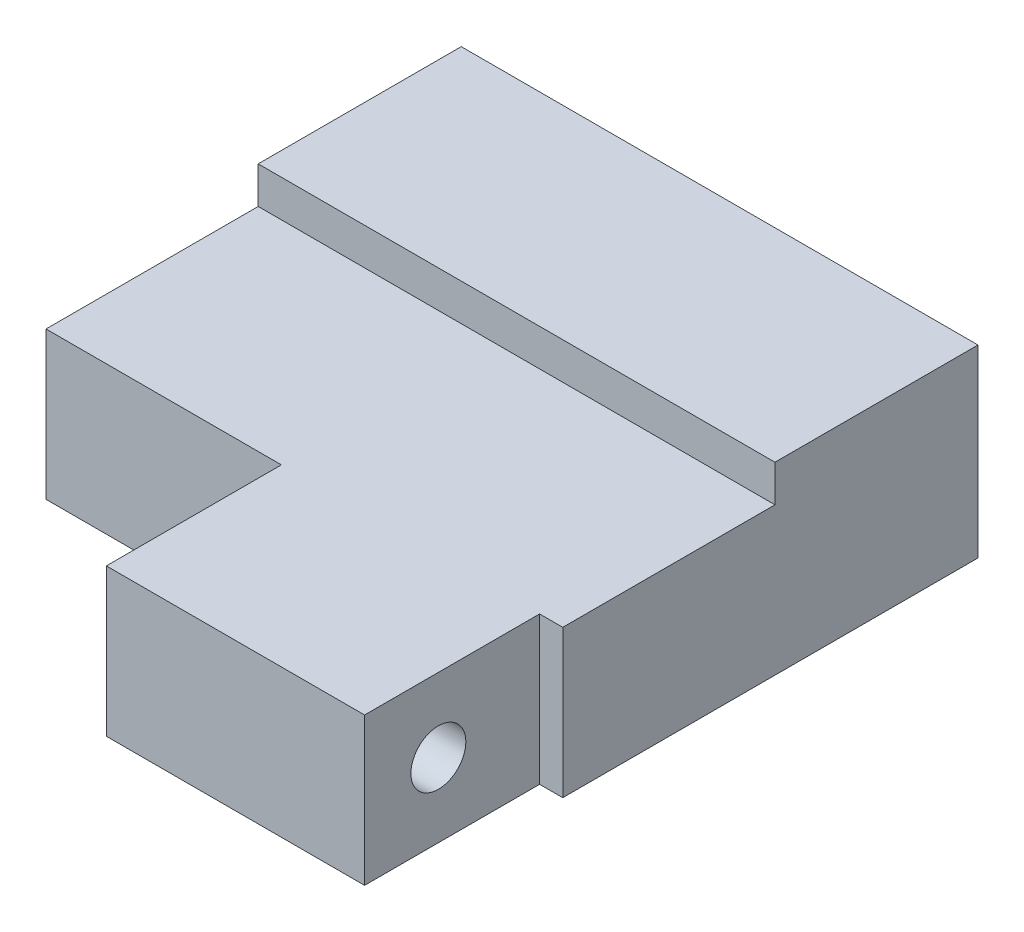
ISO-10303-21;
HEADER;
FILE_DESCRIPTION(('STEP AP214'),'2;1');
FILE_NAME('part.step','',(''),(''),'','','');
FILE_SCHEMA(('AUTOMOTIVE_DESIGN { 1 0 10303 214 1 1 1 1 }'));
ENDSEC;
DATA;
#1=APPLICATION_CONTEXT('core data for automotive mechanical design processes');
#2=APPLICATION_PROTOCOL_DEFINITION('international standard','automotive_design',2000,#1);
#3=PRODUCT_CONTEXT('',#1,'mechanical');
#4=PRODUCT('Part','Part','',(#3));
#5=PRODUCT_RELATED_PRODUCT_CATEGORY('part','',(#4));
#6=PRODUCT_DEFINITION_FORMATION('','',#4);
#7=PRODUCT_DEFINITION_CONTEXT('part definition',#1,'design');
#8=PRODUCT_DEFINITION('design','',#6,#7);
#9=PRODUCT_DEFINITION_SHAPE('','',#8);
#10=(LENGTH_UNIT() NAMED_UNIT(*) SI_UNIT(.MILLI.,.METRE.));
#11=(NAMED_UNIT(*) PLANE_ANGLE_UNIT() SI_UNIT($,.RADIAN.));
#12=(NAMED_UNIT(*) SI_UNIT($,.STERADIAN.) SOLID_ANGLE_UNIT());
#13=UNCERTAINTY_MEASURE_WITH_UNIT(LENGTH_MEASURE(1.E-05),#10,'distance_accuracy_value','');
#14=(GEOMETRIC_REPRESENTATION_CONTEXT(3) GLOBAL_UNCERTAINTY_ASSIGNED_CONTEXT((#13)) GLOBAL_UNIT_ASSIGNED_CONTEXT((#10,
#11,#12)) REPRESENTATION_CONTEXT('',''));
#15=CARTESIAN_POINT('',(0.,0.,0.));
#16=DIRECTION('',(0.,0.,1.));
#17=DIRECTION('',(1.,0.,0.));
#18=AXIS2_PLACEMENT_3D('',#15,#16,#17);
#19=CARTESIAN_POINT('',(-22.2377,4.7752,50.8));
#20=DIRECTION('',(1.,0.,0.));
#21=DIRECTION('',(0.,1.,0.));
#22=AXIS2_PLACEMENT_3D('',#19,#20,#21);
#23=PLANE('',#22);
#24=DIRECTION('',(0.,0.,1.));
#25=VECTOR('',#24,1.);
#26=CARTESIAN_POINT('',(-22.2377,1.6002,50.8));
#27=LINE('',#26,#25);
#28=CARTESIAN_POINT('',(-22.2377,1.6002,17.4752));
#29=VERTEX_POINT('',#28);
#30=CARTESIAN_POINT('',(-22.2377,1.6002,35.7378));
#31=VERTEX_POINT('',#30);
#32=EDGE_CURVE('E221',#29,#31,#27,.T.);
#33=ORIENTED_EDGE('',*,*,#32,.F.);
#34=DIRECTION('',(0.,-1.,0.));
#35=VECTOR('',#34,1.);
#36=CARTESIAN_POINT('',(-22.2377,4.7752,17.4752));
#37=LINE('',#36,#35);
#38=CARTESIAN_POINT('',(-22.2377,4.7752,17.4752));
#39=VERTEX_POINT('',#38);
#40=EDGE_CURVE('E126',#39,#29,#37,.T.);
#41=ORIENTED_EDGE('',*,*,#40,.F.);
#42=DIRECTION('',(0.,0.,-1.));
#43=VECTOR('',#42,1.);
#44=CARTESIAN_POINT('',(-22.2377,4.7752,50.8));
#45=LINE('',#44,#43);
#46=CARTESIAN_POINT('',(-22.2377,4.7752,0.));
#47=VERTEX_POINT('',#46);
#48=EDGE_CURVE('E179',#39,#47,#45,.T.);
#49=ORIENTED_EDGE('',*,*,#48,.T.);
#50=DIRECTION('',(0.,-1.,0.));
#51=VECTOR('',#50,1.);
#52=CARTESIAN_POINT('',(-22.2377,4.7752,0.));
#53=LINE('',#52,#51);
#54=CARTESIAN_POINT('',(-22.2377,-11.0998,0.));
#55=VERTEX_POINT('',#54);
#56=EDGE_CURVE('E175',#47,#55,#53,.T.);
#57=ORIENTED_EDGE('',*,*,#56,.T.);
#58=DIRECTION('',(0.,0.,-1.));
#59=VECTOR('',#58,1.);
#60=CARTESIAN_POINT('',(-22.2377,-11.0998,50.8));
#61=LINE('',#60,#59);
#62=CARTESIAN_POINT('',(-22.2377,-11.0998,35.7378));
#63=VERTEX_POINT('',#62);
#64=EDGE_CURVE('E194',#63,#55,#61,.T.);
#65=ORIENTED_EDGE('',*,*,#64,.F.);
#66=DIRECTION('',(0.,1.,0.));
#67=VECTOR('',#66,1.);
#68=CARTESIAN_POINT('',(-22.2377,-12.7,35.7378));
#69=LINE('',#68,#67);
#70=EDGE_CURVE('E155',#63,#31,#69,.T.);
#71=ORIENTED_EDGE('',*,*,#70,.T.);
#72=EDGE_LOOP('',(#33,#41,#49,#57,#65,#71));
#73=FACE_BOUND('',#72,.T.);
#74=ADVANCED_FACE('F33',(#73),#23,.F.);
#75=CARTESIAN_POINT('',(22.2377,-11.0998,50.8));
#76=DIRECTION('',(-1.,0.,0.));
#77=DIRECTION('',(0.,-1.,0.));
#78=AXIS2_PLACEMENT_3D('',#75,#76,#77);
#79=PLANE('',#78);
#80=DIRECTION('',(0.,0.,-1.));
#81=VECTOR('',#80,1.);
#82=CARTESIAN_POINT('',(22.2377,1.6002,50.8));
#83=LINE('',#82,#81);
#84=CARTESIAN_POINT('',(22.2377,1.6002,35.7378));
#85=VERTEX_POINT('',#84);
#86=CARTESIAN_POINT('',(22.2377,1.6002,17.4752));
#87=VERTEX_POINT('',#86);
#88=EDGE_CURVE('E109',#85,#87,#83,.T.);
#89=ORIENTED_EDGE('',*,*,#88,.F.);
#90=DIRECTION('',(0.,1.,0.));
#91=VECTOR('',#90,1.);
#92=CARTESIAN_POINT('',(22.2377,-12.7,35.7378));
#93=LINE('',#92,#91);
#94=CARTESIAN_POINT('',(22.2377,-11.0998,35.7378));
#95=VERTEX_POINT('',#94);
#96=EDGE_CURVE('E164',#95,#85,#93,.T.);
#97=ORIENTED_EDGE('',*,*,#96,.F.);
#98=DIRECTION('',(0.,0.,-1.));
#99=VECTOR('',#98,1.);
#100=CARTESIAN_POINT('',(22.2377,-11.0998,50.8));
#101=LINE('',#100,#99);
#102=CARTESIAN_POINT('',(22.2377,-11.0998,0.));
#103=VERTEX_POINT('',#102);
#104=EDGE_CURVE('E192',#95,#103,#101,.T.);
#105=ORIENTED_EDGE('',*,*,#104,.T.);
#106=DIRECTION('',(0.,1.,0.));
#107=VECTOR('',#106,1.);
#108=CARTESIAN_POINT('',(22.2377,-11.0998,0.));
#109=LINE('',#108,#107);
#110=CARTESIAN_POINT('',(22.2377,4.7752,0.));
#111=VERTEX_POINT('',#110);
#112=EDGE_CURVE('E186',#103,#111,#109,.T.);
#113=ORIENTED_EDGE('',*,*,#112,.T.);
#114=DIRECTION('',(0.,0.,-1.));
#115=VECTOR('',#114,1.);
#116=CARTESIAN_POINT('',(22.2377,4.7752,50.8));
#117=LINE('',#116,#115);
#118=CARTESIAN_POINT('',(22.2377,4.7752,17.4752));
#119=VERTEX_POINT('',#118);
#120=EDGE_CURVE('E133',#119,#111,#117,.T.);
#121=ORIENTED_EDGE('',*,*,#120,.F.);
#122=DIRECTION('',(0.,1.,0.));
#123=VECTOR('',#122,1.);
#124=CARTESIAN_POINT('',(22.2377,-11.0998,17.4752));
#125=LINE('',#124,#123);
#126=EDGE_CURVE('E120',#87,#119,#125,.T.);
#127=ORIENTED_EDGE('',*,*,#126,.F.);
#128=EDGE_LOOP('',(#89,#97,#105,#113,#121,#127));
#129=FACE_BOUND('',#128,.T.);
#130=ADVANCED_FACE('F131',(#129),#79,.F.);
#131=CARTESIAN_POINT('',(22.2377,4.7752,50.8));
#132=DIRECTION('',(0.,-1.,0.));
#133=DIRECTION('',(1.,0.,0.));
#134=AXIS2_PLACEMENT_3D('',#131,#132,#133);
#135=PLANE('',#134);
#136=DIRECTION('',(-1.,0.,0.));
#137=VECTOR('',#136,1.);
#138=CARTESIAN_POINT('',(38.1,4.7752,17.4752));
#139=LINE('',#138,#137);
#140=EDGE_CURVE('E128',#119,#39,#139,.T.);
#141=ORIENTED_EDGE('',*,*,#140,.F.);
#142=ORIENTED_EDGE('',*,*,#120,.T.);
#143=DIRECTION('',(-1.,0.,0.));
#144=VECTOR('',#143,1.);
#145=CARTESIAN_POINT('',(22.2377,4.7752,0.));
#146=LINE('',#145,#144);
#147=EDGE_CURVE('E180',#111,#47,#146,.T.);
#148=ORIENTED_EDGE('',*,*,#147,.T.);
#149=ORIENTED_EDGE('',*,*,#48,.F.);
#150=EDGE_LOOP('',(#141,#142,#148,#149));
#151=FACE_BOUND('',#150,.T.);
#152=ADVANCED_FACE('F238',(#151),#135,.F.);
#153=CARTESIAN_POINT('',(0.,0.,50.8));
#154=DIRECTION('',(0.,0.,1.));
#155=DIRECTION('',(1.,0.,0.));
#156=AXIS2_PLACEMENT_3D('',#153,#154,#155);
#157=PLANE('',#156);
#158=DIRECTION('',(0.,-1.,0.));
#159=VECTOR('',#158,1.);
#160=CARTESIAN_POINT('',(20.2438,0.,50.8));
#161=LINE('',#160,#159);
#162=CARTESIAN_POINT('',(20.2438,1.6002,50.8));
#163=VERTEX_POINT('',#162);
#164=CARTESIAN_POINT('',(20.2438,-11.0998,50.8));
#165=VERTEX_POINT('',#164);
#166=EDGE_CURVE('E196',#163,#165,#161,.T.);
#167=ORIENTED_EDGE('',*,*,#166,.F.);
#168=DIRECTION('',(-1.,0.,0.));
#169=VECTOR('',#168,1.);
#170=CARTESIAN_POINT('',(38.1,1.6002,50.8));
#171=LINE('',#170,#169);
#172=CARTESIAN_POINT('',(-1.98119999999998,1.6002,50.8));
#173=VERTEX_POINT('',#172);
#174=EDGE_CURVE('E127',#163,#173,#171,.T.);
#175=ORIENTED_EDGE('',*,*,#174,.T.);
#176=DIRECTION('',(0.,1.,0.));
#177=VECTOR('',#176,1.);
#178=CARTESIAN_POINT('',(-1.9812,0.,50.8));
#179=LINE('',#178,#177);
#180=CARTESIAN_POINT('',(-1.9812,-11.0998,50.8));
#181=VERTEX_POINT('',#180);
#182=EDGE_CURVE('E40',#181,#173,#179,.T.);
#183=ORIENTED_EDGE('',*,*,#182,.F.);
#184=DIRECTION('',(1.,0.,0.));
#185=VECTOR('',#184,1.);
#186=CARTESIAN_POINT('',(-22.2377,-11.0998,50.8));
#187=LINE('',#186,#185);
#188=EDGE_CURVE('E176',#181,#165,#187,.T.);
#189=ORIENTED_EDGE('',*,*,#188,.T.);
#190=EDGE_LOOP('',(#167,#175,#183,#189));
#191=FACE_BOUND('',#190,.T.);
#192=ADVANCED_FACE('F225',(#191),#157,.T.);
#193=CARTESIAN_POINT('',(22.2377,-12.7,35.7378));
#194=DIRECTION('',(0.,0.,-1.));
#195=DIRECTION('',(-1.,0.,0.));
#196=AXIS2_PLACEMENT_3D('',#193,#194,#195);
#197=PLANE('',#196);
#198=DIRECTION('',(1.,0.,0.));
#199=VECTOR('',#198,1.);
#200=CARTESIAN_POINT('',(22.2377,1.6002,35.7378));
#201=LINE('',#200,#199);
#202=CARTESIAN_POINT('',(20.2438,1.6002,35.7378));
#203=VERTEX_POINT('',#202);
#204=EDGE_CURVE('E115',#203,#85,#201,.T.);
#205=ORIENTED_EDGE('',*,*,#204,.F.);
#206=DIRECTION('',(0.,1.,0.));
#207=VECTOR('',#206,1.);
#208=CARTESIAN_POINT('',(20.2438,-12.7,35.7378));
#209=LINE('',#208,#207);
#210=CARTESIAN_POINT('',(20.2438,-11.0998,35.7378));
#211=VERTEX_POINT('',#210);
#212=EDGE_CURVE('E165',#211,#203,#209,.T.);
#213=ORIENTED_EDGE('',*,*,#212,.F.);
#214=DIRECTION('',(-1.,0.,0.));
#215=VECTOR('',#214,1.);
#216=CARTESIAN_POINT('',(-22.2377,-11.0998,35.7378));
#217=LINE('',#216,#215);
#218=EDGE_CURVE('E172',#95,#211,#217,.T.);
#219=ORIENTED_EDGE('',*,*,#218,.F.);
#220=ORIENTED_EDGE('',*,*,#96,.T.);
#221=EDGE_LOOP('',(#205,#213,#219,#220));
#222=FACE_BOUND('',#221,.T.);
#223=ADVANCED_FACE('F215',(#222),#197,.F.);
#224=CARTESIAN_POINT('',(20.2438,-12.7,35.7378));
#225=DIRECTION('',(-1.,0.,0.));
#226=DIRECTION('',(0.,0.,1.));
#227=AXIS2_PLACEMENT_3D('',#224,#225,#226);
#228=PLANE('',#227);
#229=CARTESIAN_POINT('',(20.2438,-4.7498,44.45));
#230=DIRECTION('',(-1.,0.,0.));
#231=DIRECTION('',(0.,0.,1.));
#232=AXIS2_PLACEMENT_3D('',#229,#230,#231);
#233=CIRCLE('',#232,2.36516097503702);
#234=CARTESIAN_POINT('',(20.2438,-4.7498,46.815160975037));
#235=VERTEX_POINT('',#234);
#236=EDGE_CURVE('E151',#235,#235,#233,.T.);
#237=ORIENTED_EDGE('',*,*,#236,.T.);
#238=EDGE_LOOP('',(#237));
#239=FACE_BOUND('',#238,.T.);
#240=DIRECTION('',(0.,0.,-1.));
#241=VECTOR('',#240,1.);
#242=CARTESIAN_POINT('',(20.2438,1.6002,35.7378));
#243=LINE('',#242,#241);
#244=EDGE_CURVE('E218',#163,#203,#243,.T.);
#245=ORIENTED_EDGE('',*,*,#244,.F.);
#246=ORIENTED_EDGE('',*,*,#166,.T.);
#247=DIRECTION('',(0.,0.,1.));
#248=VECTOR('',#247,1.);
#249=CARTESIAN_POINT('',(20.2438,-11.0998,50.8));
#250=LINE('',#249,#248);
#251=EDGE_CURVE('E168',#211,#165,#250,.T.);
#252=ORIENTED_EDGE('',*,*,#251,.F.);
#253=ORIENTED_EDGE('',*,*,#212,.T.);
#254=EDGE_LOOP('',(#245,#246,#252,#253));
#255=FACE_BOUND('',#254,.T.);
#256=ADVANCED_FACE('F211',(#239,#255),#228,.F.);
#257=CARTESIAN_POINT('',(-1.9812,-12.7,35.7378));
#258=DIRECTION('',(0.,0.,-1.));
#259=DIRECTION('',(-1.,0.,0.));
#260=AXIS2_PLACEMENT_3D('',#257,#258,#259);
#261=PLANE('',#260);
#262=DIRECTION('',(1.,0.,0.));
#263=VECTOR('',#262,1.);
#264=CARTESIAN_POINT('',(-1.9812,1.6002,35.7378));
#265=LINE('',#264,#263);
#266=CARTESIAN_POINT('',(-1.9812,1.6002,35.7378));
#267=VERTEX_POINT('',#266);
#268=EDGE_CURVE('E46',#31,#267,#265,.T.);
#269=ORIENTED_EDGE('',*,*,#268,.F.);
#270=ORIENTED_EDGE('',*,*,#70,.F.);
#271=DIRECTION('',(-1.,0.,0.));
#272=VECTOR('',#271,1.);
#273=CARTESIAN_POINT('',(-22.2377,-11.0998,35.7378));
#274=LINE('',#273,#272);
#275=CARTESIAN_POINT('',(-1.9812,-11.0998,35.7378));
#276=VERTEX_POINT('',#275);
#277=EDGE_CURVE('E161',#276,#63,#274,.T.);
#278=ORIENTED_EDGE('',*,*,#277,.F.);
#279=DIRECTION('',(0.,1.,0.));
#280=VECTOR('',#279,1.);
#281=CARTESIAN_POINT('',(-1.9812,-12.7,35.7378));
#282=LINE('',#281,#280);
#283=EDGE_CURVE('E154',#276,#267,#282,.T.);
#284=ORIENTED_EDGE('',*,*,#283,.T.);
#285=EDGE_LOOP('',(#269,#270,#278,#284));
#286=FACE_BOUND('',#285,.T.);
#287=ADVANCED_FACE('F214',(#286),#261,.F.);
#288=CARTESIAN_POINT('',(-1.9812,-12.7,50.8));
#289=DIRECTION('',(1.,0.,0.));
#290=DIRECTION('',(0.,0.,-1.));
#291=AXIS2_PLACEMENT_3D('',#288,#289,#290);
#292=PLANE('',#291);
#293=CARTESIAN_POINT('',(-1.9812,-4.7498,44.45));
#294=DIRECTION('',(1.,0.,0.));
#295=DIRECTION('',(0.,0.,-1.));
#296=AXIS2_PLACEMENT_3D('',#293,#294,#295);
#297=CIRCLE('',#296,2.36516097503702);
#298=CARTESIAN_POINT('',(-1.9812,-4.7498,42.084839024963));
#299=VERTEX_POINT('',#298);
#300=EDGE_CURVE('E148',#299,#299,#297,.T.);
#301=ORIENTED_EDGE('',*,*,#300,.T.);
#302=EDGE_LOOP('',(#301));
#303=FACE_BOUND('',#302,.T.);
#304=DIRECTION('',(0.,0.,1.));
#305=VECTOR('',#304,1.);
#306=CARTESIAN_POINT('',(-1.9812,1.6002,50.8));
#307=LINE('',#306,#305);
#308=EDGE_CURVE('E11',#267,#173,#307,.T.);
#309=ORIENTED_EDGE('',*,*,#308,.F.);
#310=ORIENTED_EDGE('',*,*,#283,.F.);
#311=DIRECTION('',(0.,0.,-1.));
#312=VECTOR('',#311,1.);
#313=CARTESIAN_POINT('',(-1.9812,-11.0998,50.8));
#314=LINE('',#313,#312);
#315=EDGE_CURVE('E54',#181,#276,#314,.T.);
#316=ORIENTED_EDGE('',*,*,#315,.F.);
#317=ORIENTED_EDGE('',*,*,#182,.T.);
#318=EDGE_LOOP('',(#309,#310,#316,#317));
#319=FACE_BOUND('',#318,.T.);
#320=ADVANCED_FACE('F201',(#303,#319),#292,.F.);
#321=CARTESIAN_POINT('',(-22.2377,-11.0998,50.8));
#322=DIRECTION('',(0.,1.,0.));
#323=DIRECTION('',(0.,0.,1.));
#324=AXIS2_PLACEMENT_3D('',#321,#322,#323);
#325=PLANE('',#324);
#326=ORIENTED_EDGE('',*,*,#315,.T.);
#327=ORIENTED_EDGE('',*,*,#277,.T.);
#328=ORIENTED_EDGE('',*,*,#64,.T.);
#329=DIRECTION('',(1.,0.,0.));
#330=VECTOR('',#329,1.);
#331=CARTESIAN_POINT('',(-22.2377,-11.0998,0.));
#332=LINE('',#331,#330);
#333=EDGE_CURVE('E183',#55,#103,#332,.T.);
#334=ORIENTED_EDGE('',*,*,#333,.T.);
#335=ORIENTED_EDGE('',*,*,#104,.F.);
#336=ORIENTED_EDGE('',*,*,#218,.T.);
#337=ORIENTED_EDGE('',*,*,#251,.T.);
#338=ORIENTED_EDGE('',*,*,#188,.F.);
#339=EDGE_LOOP('',(#326,#327,#328,#334,#335,#336,#337,#338));
#340=FACE_BOUND('',#339,.T.);
#341=ADVANCED_FACE('F228',(#340),#325,.F.);
#342=CARTESIAN_POINT('',(0.,0.,0.));
#343=DIRECTION('',(0.,0.,1.));
#344=DIRECTION('',(1.,0.,0.));
#345=AXIS2_PLACEMENT_3D('',#342,#343,#344);
#346=PLANE('',#345);
#347=CARTESIAN_POINT('',(-17.4625,0.,0.));
#348=DIRECTION('',(0.,0.,-1.));
#349=DIRECTION('',(-1.,0.,0.));
#350=AXIS2_PLACEMENT_3D('',#347,#348,#349);
#351=CIRCLE('',#350,2.3876);
#352=CARTESIAN_POINT('',(-19.8501,0.,0.));
#353=VERTEX_POINT('',#352);
#354=EDGE_CURVE('E135',#353,#353,#351,.T.);
#355=ORIENTED_EDGE('',*,*,#354,.F.);
#356=EDGE_LOOP('',(#355));
#357=FACE_BOUND('',#356,.T.);
#358=CARTESIAN_POINT('',(17.4625,0.,0.));
#359=DIRECTION('',(0.,0.,-1.));
#360=DIRECTION('',(-1.,0.,0.));
#361=AXIS2_PLACEMENT_3D('',#358,#359,#360);
#362=CIRCLE('',#361,2.3876);
#363=CARTESIAN_POINT('',(15.0749,0.,0.));
#364=VERTEX_POINT('',#363);
#365=EDGE_CURVE('E142',#364,#364,#362,.T.);
#366=ORIENTED_EDGE('',*,*,#365,.F.);
#367=EDGE_LOOP('',(#366));
#368=FACE_BOUND('',#367,.T.);
#369=ORIENTED_EDGE('',*,*,#56,.F.);
#370=ORIENTED_EDGE('',*,*,#147,.F.);
#371=ORIENTED_EDGE('',*,*,#112,.F.);
#372=ORIENTED_EDGE('',*,*,#333,.F.);
#373=EDGE_LOOP('',(#369,#370,#371,#372));
#374=FACE_BOUND('',#373,.T.);
#375=ADVANCED_FACE('F207',(#357,#368,#374),#346,.F.);
#376=CARTESIAN_POINT('',(-25.4,-4.7498,44.45));
#377=DIRECTION('',(1.,0.,0.));
#378=DIRECTION('',(0.,0.,-1.));
#379=AXIS2_PLACEMENT_3D('',#376,#377,#378);
#380=CYLINDRICAL_SURFACE('',#379,2.36516097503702);
#381=ORIENTED_EDGE('',*,*,#300,.F.);
#382=EDGE_LOOP('',(#381));
#383=FACE_BOUND('',#382,.T.);
#384=ORIENTED_EDGE('',*,*,#236,.F.);
#385=EDGE_LOOP('',(#384));
#386=FACE_BOUND('',#385,.T.);
#387=ADVANCED_FACE('F203',(#383,#386),#380,.F.);
#388=CARTESIAN_POINT('',(17.4625,0.,15.875));
#389=DIRECTION('',(0.,0.,-1.));
#390=DIRECTION('',(-1.,0.,0.));
#391=AXIS2_PLACEMENT_3D('',#388,#389,#390);
#392=CYLINDRICAL_SURFACE('',#391,2.3876);
#393=CARTESIAN_POINT('',(17.4625,0.,15.875));
#394=DIRECTION('',(0.,0.,-1.));
#395=DIRECTION('',(-1.,0.,0.));
#396=AXIS2_PLACEMENT_3D('',#393,#394,#395);
#397=CIRCLE('',#396,2.3876);
#398=CARTESIAN_POINT('',(15.0749,0.,15.875));
#399=VERTEX_POINT('',#398);
#400=EDGE_CURVE('E145',#399,#399,#397,.T.);
#401=ORIENTED_EDGE('',*,*,#400,.F.);
#402=EDGE_LOOP('',(#401));
#403=FACE_BOUND('',#402,.T.);
#404=ORIENTED_EDGE('',*,*,#365,.T.);
#405=EDGE_LOOP('',(#404));
#406=FACE_BOUND('',#405,.T.);
#407=ADVANCED_FACE('F206',(#403,#406),#392,.F.);
#408=CARTESIAN_POINT('',(17.4625,0.,15.875));
#409=DIRECTION('',(0.,0.,-1.));
#410=DIRECTION('',(-1.,0.,0.));
#411=AXIS2_PLACEMENT_3D('',#408,#409,#410);
#412=PLANE('',#411);
#413=ORIENTED_EDGE('',*,*,#400,.T.);
#414=EDGE_LOOP('',(#413));
#415=FACE_BOUND('',#414,.T.);
#416=ADVANCED_FACE('F315',(#415),#412,.T.);
#417=CARTESIAN_POINT('',(-17.4625,0.,15.875));
#418=DIRECTION('',(0.,0.,-1.));
#419=DIRECTION('',(-1.,0.,0.));
#420=AXIS2_PLACEMENT_3D('',#417,#418,#419);
#421=CYLINDRICAL_SURFACE('',#420,2.3876);
#422=CARTESIAN_POINT('',(-17.4625,0.,15.875));
#423=DIRECTION('',(0.,0.,-1.));
#424=DIRECTION('',(-1.,0.,0.));
#425=AXIS2_PLACEMENT_3D('',#422,#423,#424);
#426=CIRCLE('',#425,2.3876);
#427=CARTESIAN_POINT('',(-19.8501,0.,15.875));
#428=VERTEX_POINT('',#427);
#429=EDGE_CURVE('E139',#428,#428,#426,.T.);
#430=ORIENTED_EDGE('',*,*,#429,.F.);
#431=EDGE_LOOP('',(#430));
#432=FACE_BOUND('',#431,.T.);
#433=ORIENTED_EDGE('',*,*,#354,.T.);
#434=EDGE_LOOP('',(#433));
#435=FACE_BOUND('',#434,.T.);
#436=ADVANCED_FACE('F311',(#432,#435),#421,.F.);
#437=CARTESIAN_POINT('',(-17.4625,0.,15.875));
#438=DIRECTION('',(0.,0.,-1.));
#439=DIRECTION('',(-1.,0.,0.));
#440=AXIS2_PLACEMENT_3D('',#437,#438,#439);
#441=PLANE('',#440);
#442=ORIENTED_EDGE('',*,*,#429,.T.);
#443=EDGE_LOOP('',(#442));
#444=FACE_BOUND('',#443,.T.);
#445=ADVANCED_FACE('F295',(#444),#441,.T.);
#446=CARTESIAN_POINT('',(38.1,4.7752,17.4752));
#447=DIRECTION('',(0.,0.,1.));
#448=DIRECTION('',(1.,0.,0.));
#449=AXIS2_PLACEMENT_3D('',#446,#447,#448);
#450=PLANE('',#449);
#451=ORIENTED_EDGE('',*,*,#40,.T.);
#452=DIRECTION('',(-1.,0.,0.));
#453=VECTOR('',#452,1.);
#454=CARTESIAN_POINT('',(38.1,1.6002,17.4752));
#455=LINE('',#454,#453);
#456=EDGE_CURVE('E112',#87,#29,#455,.T.);
#457=ORIENTED_EDGE('',*,*,#456,.F.);
#458=ORIENTED_EDGE('',*,*,#126,.T.);
#459=ORIENTED_EDGE('',*,*,#140,.T.);
#460=EDGE_LOOP('',(#451,#457,#458,#459));
#461=FACE_BOUND('',#460,.T.);
#462=ADVANCED_FACE('F123',(#461),#450,.T.);
#463=CARTESIAN_POINT('',(38.1,1.6002,17.4752));
#464=DIRECTION('',(0.,1.,0.));
#465=DIRECTION('',(0.,0.,1.));
#466=AXIS2_PLACEMENT_3D('',#463,#464,#465);
#467=PLANE('',#466);
#468=ORIENTED_EDGE('',*,*,#88,.T.);
#469=ORIENTED_EDGE('',*,*,#456,.T.);
#470=ORIENTED_EDGE('',*,*,#32,.T.);
#471=ORIENTED_EDGE('',*,*,#268,.T.);
#472=ORIENTED_EDGE('',*,*,#308,.T.);
#473=ORIENTED_EDGE('',*,*,#174,.F.);
#474=ORIENTED_EDGE('',*,*,#244,.T.);
#475=ORIENTED_EDGE('',*,*,#204,.T.);
#476=EDGE_LOOP('',(#468,#469,#470,#471,#472,#473,#474,#475));
#477=FACE_BOUND('',#476,.T.);
#478=ADVANCED_FACE('F111',(#477),#467,.T.);
#479=CLOSED_SHELL('',(#74,#130,#152,#192,#223,#256,#287,#320,#341,#375,#387,#407,#416,#436,#445,
#462,#478));
#480=MANIFOLD_SOLID_BREP('B2',#479);
#481=ADVANCED_BREP_SHAPE_REPRESENTATION('',(#18,#480),#14);
#482=SHAPE_DEFINITION_REPRESENTATION(#9,#481);
ENDSEC;
END-ISO-10303-21;
